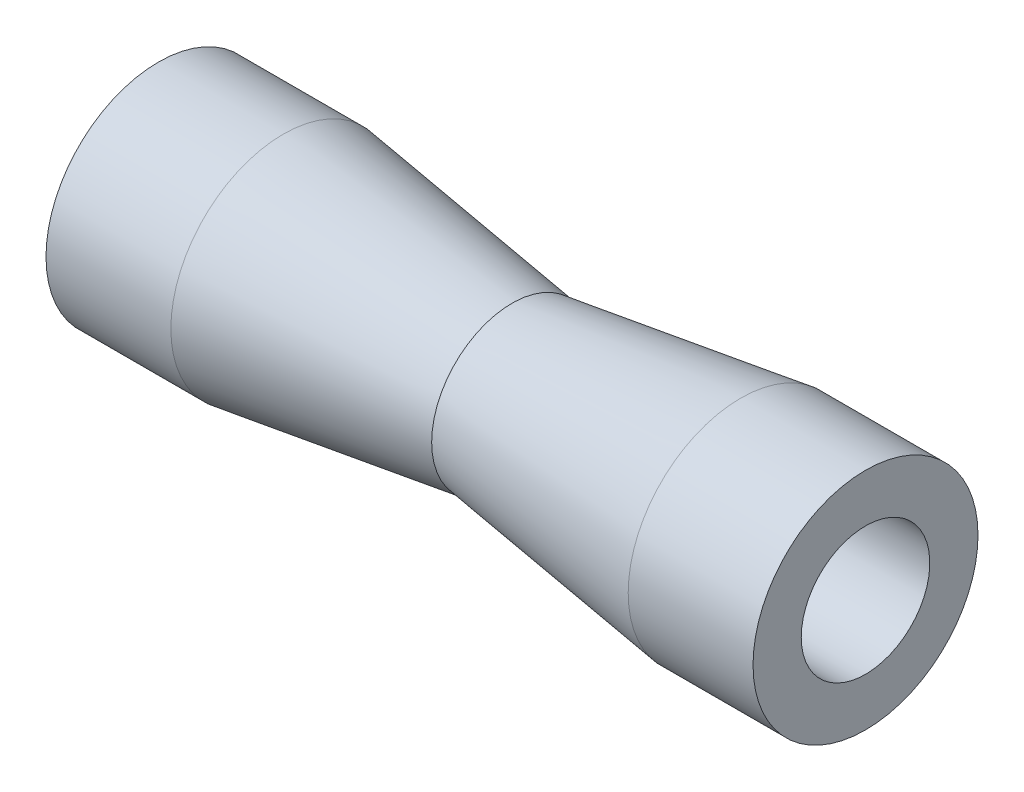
ISO-10303-21;
HEADER;
FILE_DESCRIPTION(('STEP AP214'),'2;1');
FILE_NAME('part.step','',(''),(''),'','','');
FILE_SCHEMA(('AUTOMOTIVE_DESIGN { 1 0 10303 214 1 1 1 1 }'));
ENDSEC;
DATA;
#1=APPLICATION_CONTEXT('core data for automotive mechanical design processes');
#2=APPLICATION_PROTOCOL_DEFINITION('international standard','automotive_design',2000,#1);
#3=PRODUCT_CONTEXT('',#1,'mechanical');
#4=PRODUCT('Part','Part','',(#3));
#5=PRODUCT_RELATED_PRODUCT_CATEGORY('part','',(#4));
#6=PRODUCT_DEFINITION_FORMATION('','',#4);
#7=PRODUCT_DEFINITION_CONTEXT('part definition',#1,'design');
#8=PRODUCT_DEFINITION('design','',#6,#7);
#9=PRODUCT_DEFINITION_SHAPE('','',#8);
#10=(LENGTH_UNIT() NAMED_UNIT(*) SI_UNIT(.MILLI.,.METRE.));
#11=(NAMED_UNIT(*) PLANE_ANGLE_UNIT() SI_UNIT($,.RADIAN.));
#12=(NAMED_UNIT(*) SI_UNIT($,.STERADIAN.) SOLID_ANGLE_UNIT());
#13=UNCERTAINTY_MEASURE_WITH_UNIT(LENGTH_MEASURE(1.E-05),#10,'distance_accuracy_value','');
#14=(GEOMETRIC_REPRESENTATION_CONTEXT(3) GLOBAL_UNCERTAINTY_ASSIGNED_CONTEXT((#13)) GLOBAL_UNIT_ASSIGNED_CONTEXT((#10,
#11,#12)) REPRESENTATION_CONTEXT('',''));
#15=CARTESIAN_POINT('',(0.,0.,0.));
#16=DIRECTION('',(0.,0.,1.));
#17=DIRECTION('',(1.,0.,0.));
#18=AXIS2_PLACEMENT_3D('',#15,#16,#17);
#19=CARTESIAN_POINT('',(0.,11.1125,0.));
#20=DIRECTION('',(1.,0.,0.));
#21=DIRECTION('',(0.,0.,-1.));
#22=AXIS2_PLACEMENT_3D('',#19,#20,#21);
#23=PLANE('',#22);
#24=CARTESIAN_POINT('',(0.,0.,0.));
#25=DIRECTION('',(-1.,0.,0.));
#26=DIRECTION('',(0.,0.,1.));
#27=AXIS2_PLACEMENT_3D('',#24,#25,#26);
#28=CIRCLE('',#27,6.35);
#29=CARTESIAN_POINT('',(0.,0.,6.35));
#30=VERTEX_POINT('',#29);
#31=EDGE_CURVE('E10',#30,#30,#28,.T.);
#32=ORIENTED_EDGE('',*,*,#31,.F.);
#33=EDGE_LOOP('',(#32));
#34=FACE_BOUND('',#33,.T.);
#35=CARTESIAN_POINT('',(0.,0.,0.));
#36=DIRECTION('',(-1.,0.,0.));
#37=DIRECTION('',(0.,0.,1.));
#38=AXIS2_PLACEMENT_3D('',#35,#36,#37);
#39=CIRCLE('',#38,11.1125);
#40=CARTESIAN_POINT('',(0.,0.,11.1125));
#41=VERTEX_POINT('',#40);
#42=EDGE_CURVE('E56',#41,#41,#39,.T.);
#43=ORIENTED_EDGE('',*,*,#42,.T.);
#44=EDGE_LOOP('',(#43));
#45=FACE_BOUND('',#44,.T.);
#46=ADVANCED_FACE('F31',(#34,#45),#23,.F.);
#47=CARTESIAN_POINT('',(0.,0.,0.));
#48=DIRECTION('',(-1.,0.,0.));
#49=DIRECTION('',(0.,0.,1.));
#50=AXIS2_PLACEMENT_3D('',#47,#48,#49);
#51=CYLINDRICAL_SURFACE('',#50,6.35);
#52=CARTESIAN_POINT('',(69.85,0.,0.));
#53=DIRECTION('',(-1.,0.,0.));
#54=DIRECTION('',(0.,0.,1.));
#55=AXIS2_PLACEMENT_3D('',#52,#53,#54);
#56=CIRCLE('',#55,6.35);
#57=CARTESIAN_POINT('',(69.85,0.,6.35));
#58=VERTEX_POINT('',#57);
#59=EDGE_CURVE('E37',#58,#58,#56,.T.);
#60=ORIENTED_EDGE('',*,*,#59,.F.);
#61=EDGE_LOOP('',(#60));
#62=FACE_BOUND('',#61,.T.);
#63=ORIENTED_EDGE('',*,*,#31,.T.);
#64=EDGE_LOOP('',(#63));
#65=FACE_BOUND('',#64,.T.);
#66=ADVANCED_FACE('F87',(#62,#65),#51,.F.);
#67=CARTESIAN_POINT('',(69.85,6.35,0.));
#68=DIRECTION('',(-1.,0.,0.));
#69=DIRECTION('',(0.,0.,1.));
#70=AXIS2_PLACEMENT_3D('',#67,#68,#69);
#71=PLANE('',#70);
#72=CARTESIAN_POINT('',(69.85,0.,0.));
#73=DIRECTION('',(-1.,0.,0.));
#74=DIRECTION('',(0.,0.,1.));
#75=AXIS2_PLACEMENT_3D('',#72,#73,#74);
#76=CIRCLE('',#75,11.1125);
#77=CARTESIAN_POINT('',(69.85,0.,11.1125));
#78=VERTEX_POINT('',#77);
#79=EDGE_CURVE('E41',#78,#78,#76,.T.);
#80=ORIENTED_EDGE('',*,*,#79,.F.);
#81=EDGE_LOOP('',(#80));
#82=FACE_BOUND('',#81,.T.);
#83=ORIENTED_EDGE('',*,*,#59,.T.);
#84=EDGE_LOOP('',(#83));
#85=FACE_BOUND('',#84,.T.);
#86=ADVANCED_FACE('F82',(#82,#85),#71,.F.);
#87=CARTESIAN_POINT('',(0.,0.,0.));
#88=DIRECTION('',(-1.,0.,0.));
#89=DIRECTION('',(0.,0.,1.));
#90=AXIS2_PLACEMENT_3D('',#87,#88,#89);
#91=CYLINDRICAL_SURFACE('',#90,11.1125);
#92=CARTESIAN_POINT('',(57.5162988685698,0.,0.));
#93=DIRECTION('',(-1.,0.,0.));
#94=DIRECTION('',(0.,0.,1.));
#95=AXIS2_PLACEMENT_3D('',#92,#93,#94);
#96=CIRCLE('',#95,11.1125);
#97=CARTESIAN_POINT('',(57.5162988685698,0.,11.1125));
#98=VERTEX_POINT('',#97);
#99=EDGE_CURVE('E45',#98,#98,#96,.T.);
#100=ORIENTED_EDGE('',*,*,#99,.F.);
#101=EDGE_LOOP('',(#100));
#102=FACE_BOUND('',#101,.T.);
#103=ORIENTED_EDGE('',*,*,#79,.T.);
#104=EDGE_LOOP('',(#103));
#105=FACE_BOUND('',#104,.T.);
#106=ADVANCED_FACE('F76',(#102,#105),#91,.T.);
#107=CARTESIAN_POINT('',(57.5162988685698,0.,0.));
#108=DIRECTION('',(1.,0.,0.));
#109=DIRECTION('',(0.,0.,-1.));
#110=AXIS2_PLACEMENT_3D('',#107,#108,#109);
#111=CONICAL_SURFACE('',#110,11.1125,0.139626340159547);
#112=CARTESIAN_POINT('',(34.925,0.,0.));
#113=DIRECTION('',(-1.,0.,0.));
#114=DIRECTION('',(0.,0.,1.));
#115=AXIS2_PLACEMENT_3D('',#112,#113,#114);
#116=CIRCLE('',#115,7.9375);
#117=CARTESIAN_POINT('',(34.925,0.,7.9375));
#118=VERTEX_POINT('',#117);
#119=EDGE_CURVE('E50',#118,#118,#116,.T.);
#120=ORIENTED_EDGE('',*,*,#119,.F.);
#121=EDGE_LOOP('',(#120));
#122=FACE_BOUND('',#121,.T.);
#123=ORIENTED_EDGE('',*,*,#99,.T.);
#124=EDGE_LOOP('',(#123));
#125=FACE_BOUND('',#124,.T.);
#126=ADVANCED_FACE('F70',(#122,#125),#111,.T.);
#127=CARTESIAN_POINT('',(34.925,0.,0.));
#128=DIRECTION('',(-1.,0.,0.));
#129=DIRECTION('',(0.,0.,1.));
#130=AXIS2_PLACEMENT_3D('',#127,#128,#129);
#131=CONICAL_SURFACE('',#130,7.9375,0.139626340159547);
#132=CARTESIAN_POINT('',(12.3337011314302,0.,0.));
#133=DIRECTION('',(-1.,0.,0.));
#134=DIRECTION('',(0.,0.,1.));
#135=AXIS2_PLACEMENT_3D('',#132,#133,#134);
#136=CIRCLE('',#135,11.1125);
#137=CARTESIAN_POINT('',(12.3337011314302,0.,11.1125));
#138=VERTEX_POINT('',#137);
#139=EDGE_CURVE('E53',#138,#138,#136,.T.);
#140=ORIENTED_EDGE('',*,*,#139,.F.);
#141=EDGE_LOOP('',(#140));
#142=FACE_BOUND('',#141,.T.);
#143=ORIENTED_EDGE('',*,*,#119,.T.);
#144=EDGE_LOOP('',(#143));
#145=FACE_BOUND('',#144,.T.);
#146=ADVANCED_FACE('F64',(#142,#145),#131,.T.);
#147=CARTESIAN_POINT('',(0.,0.,0.));
#148=DIRECTION('',(-1.,0.,0.));
#149=DIRECTION('',(0.,0.,1.));
#150=AXIS2_PLACEMENT_3D('',#147,#148,#149);
#151=CYLINDRICAL_SURFACE('',#150,11.1125);
#152=ORIENTED_EDGE('',*,*,#42,.F.);
#153=EDGE_LOOP('',(#152));
#154=FACE_BOUND('',#153,.T.);
#155=ORIENTED_EDGE('',*,*,#139,.T.);
#156=EDGE_LOOP('',(#155));
#157=FACE_BOUND('',#156,.T.);
#158=ADVANCED_FACE('F61',(#154,#157),#151,.T.);
#159=CLOSED_SHELL('',(#46,#66,#86,#106,#126,#146,#158));
#160=MANIFOLD_SOLID_BREP('B2',#159);
#161=ADVANCED_BREP_SHAPE_REPRESENTATION('',(#18,#160),#14);
#162=SHAPE_DEFINITION_REPRESENTATION(#9,#161);
ENDSEC;
END-ISO-10303-21;
